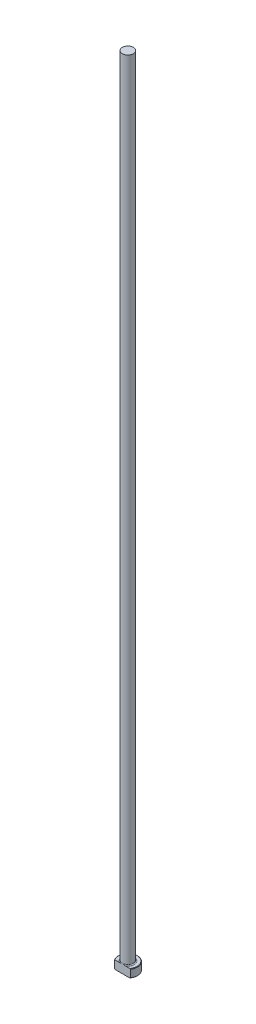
ISO-10303-21;
HEADER;
FILE_DESCRIPTION(('STEP AP214'),'2;1');
FILE_NAME('part.step','',(''),(''),'','','');
FILE_SCHEMA(('AUTOMOTIVE_DESIGN { 1 0 10303 214 1 1 1 1 }'));
ENDSEC;
DATA;
#1=APPLICATION_CONTEXT('core data for automotive mechanical design processes');
#2=APPLICATION_PROTOCOL_DEFINITION('international standard','automotive_design',2000,#1);
#3=PRODUCT_CONTEXT('',#1,'mechanical');
#4=PRODUCT('Part','Part','',(#3));
#5=PRODUCT_RELATED_PRODUCT_CATEGORY('part','',(#4));
#6=PRODUCT_DEFINITION_FORMATION('','',#4);
#7=PRODUCT_DEFINITION_CONTEXT('part definition',#1,'design');
#8=PRODUCT_DEFINITION('design','',#6,#7);
#9=PRODUCT_DEFINITION_SHAPE('','',#8);
#10=(LENGTH_UNIT() NAMED_UNIT(*) SI_UNIT(.MILLI.,.METRE.));
#11=(NAMED_UNIT(*) PLANE_ANGLE_UNIT() SI_UNIT($,.RADIAN.));
#12=(NAMED_UNIT(*) SI_UNIT($,.STERADIAN.) SOLID_ANGLE_UNIT());
#13=UNCERTAINTY_MEASURE_WITH_UNIT(LENGTH_MEASURE(1.E-05),#10,'distance_accuracy_value','');
#14=(GEOMETRIC_REPRESENTATION_CONTEXT(3) GLOBAL_UNCERTAINTY_ASSIGNED_CONTEXT((#13)) GLOBAL_UNIT_ASSIGNED_CONTEXT((#10,
#11,#12)) REPRESENTATION_CONTEXT('',''));
#15=CARTESIAN_POINT('',(0.,0.,0.));
#16=DIRECTION('',(0.,0.,1.));
#17=DIRECTION('',(1.,0.,0.));
#18=AXIS2_PLACEMENT_3D('',#15,#16,#17);
#19=CARTESIAN_POINT('',(0.,0.,0.));
#20=DIRECTION('',(0.,-1.,0.));
#21=DIRECTION('',(0.,0.,-1.));
#22=AXIS2_PLACEMENT_3D('',#19,#20,#21);
#23=PLANE('',#22);
#24=DIRECTION('',(1.,0.,0.));
#25=VECTOR('',#24,1.);
#26=CARTESIAN_POINT('',(-4.55200670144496,0.,3.17499999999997));
#27=LINE('',#26,#25);
#28=CARTESIAN_POINT('',(-4.23862381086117,0.,3.17499999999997));
#29=VERTEX_POINT('',#28);
#30=CARTESIAN_POINT('',(4.23862381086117,0.,3.17499999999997));
#31=VERTEX_POINT('',#30);
#32=EDGE_CURVE('E92',#29,#31,#27,.T.);
#33=ORIENTED_EDGE('',*,*,#32,.F.);
#34=CARTESIAN_POINT('',(0.,0.,0.));
#35=DIRECTION('',(0.,-1.,0.));
#36=DIRECTION('',(0.,0.,-1.));
#37=AXIS2_PLACEMENT_3D('',#34,#35,#36);
#38=CIRCLE('',#37,5.29589999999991);
#39=EDGE_CURVE('E105',#29,#31,#38,.T.);
#40=ORIENTED_EDGE('',*,*,#39,.T.);
#41=EDGE_LOOP('',(#33,#40));
#42=FACE_BOUND('',#41,.T.);
#43=ADVANCED_FACE('F37',(#42),#23,.T.);
#44=CARTESIAN_POINT('',(0.,259.958771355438,0.));
#45=DIRECTION('',(0.,1.,0.));
#46=DIRECTION('',(0.,0.,1.));
#47=AXIS2_PLACEMENT_3D('',#44,#45,#46);
#48=CYLINDRICAL_SURFACE('',#47,5.54989999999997);
#49=DIRECTION('',(0.,-1.,0.));
#50=VECTOR('',#49,1.);
#51=CARTESIAN_POINT('',(-4.55200670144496,457.2,3.17499999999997));
#52=LINE('',#51,#50);
#53=CARTESIAN_POINT('',(-4.55200670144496,4.49580000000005,3.17499999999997));
#54=VERTEX_POINT('',#53);
#55=CARTESIAN_POINT('',(-4.55200670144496,0.254000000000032,3.17499999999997));
#56=VERTEX_POINT('',#55);
#57=EDGE_CURVE('E95',#54,#56,#52,.T.);
#58=ORIENTED_EDGE('',*,*,#57,.F.);
#59=CARTESIAN_POINT('',(0.,4.49580000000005,0.));
#60=DIRECTION('',(0.,1.,0.));
#61=DIRECTION('',(0.,0.,1.));
#62=AXIS2_PLACEMENT_3D('',#59,#60,#61);
#63=CIRCLE('',#62,5.54989999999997);
#64=CARTESIAN_POINT('',(4.55200670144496,4.49580000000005,3.17499999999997));
#65=VERTEX_POINT('',#64);
#66=EDGE_CURVE('E109',#54,#65,#63,.F.);
#67=ORIENTED_EDGE('',*,*,#66,.T.);
#68=DIRECTION('',(0.,-1.,0.));
#69=VECTOR('',#68,1.);
#70=CARTESIAN_POINT('',(4.55200670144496,457.2,3.17499999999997));
#71=LINE('',#70,#69);
#72=CARTESIAN_POINT('',(4.55200670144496,0.254000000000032,3.17499999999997));
#73=VERTEX_POINT('',#72);
#74=EDGE_CURVE('E187',#65,#73,#71,.T.);
#75=ORIENTED_EDGE('',*,*,#74,.T.);
#76=CARTESIAN_POINT('',(0.,0.254000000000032,0.));
#77=DIRECTION('',(0.,-1.,0.));
#78=DIRECTION('',(0.,0.,-1.));
#79=AXIS2_PLACEMENT_3D('',#76,#77,#78);
#80=CIRCLE('',#79,5.54989999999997);
#81=EDGE_CURVE('E115',#73,#56,#80,.F.);
#82=ORIENTED_EDGE('',*,*,#81,.T.);
#83=EDGE_LOOP('',(#58,#67,#75,#82));
#84=FACE_BOUND('',#83,.T.);
#85=ADVANCED_FACE('F160',(#84),#48,.T.);
#86=CARTESIAN_POINT('',(-5.54989999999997,4.7498,0.));
#87=DIRECTION('',(0.,1.,0.));
#88=DIRECTION('',(0.,0.,1.));
#89=AXIS2_PLACEMENT_3D('',#86,#87,#88);
#90=PLANE('',#89);
#91=DIRECTION('',(-1.,0.,0.));
#92=VECTOR('',#91,1.);
#93=CARTESIAN_POINT('',(-5.54989999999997,4.7498,3.17499999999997));
#94=LINE('',#93,#92);
#95=CARTESIAN_POINT('',(4.23862381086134,4.7498,3.17499999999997));
#96=VERTEX_POINT('',#95);
#97=CARTESIAN_POINT('',(1.86651118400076,4.7498,3.17499999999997));
#98=VERTEX_POINT('',#97);
#99=EDGE_CURVE('E58',#96,#98,#94,.T.);
#100=ORIENTED_EDGE('',*,*,#99,.F.);
#101=CARTESIAN_POINT('',(0.,4.7498,0.));
#102=DIRECTION('',(0.,1.,0.));
#103=DIRECTION('',(0.,0.,1.));
#104=AXIS2_PLACEMENT_3D('',#101,#102,#103);
#105=CIRCLE('',#104,5.29590000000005);
#106=CARTESIAN_POINT('',(-4.23862381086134,4.7498,3.17499999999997));
#107=VERTEX_POINT('',#106);
#108=EDGE_CURVE('E182',#96,#107,#105,.T.);
#109=ORIENTED_EDGE('',*,*,#108,.T.);
#110=CARTESIAN_POINT('',(-1.86651118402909,4.74979999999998,3.17499999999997));
#111=VERTEX_POINT('',#110);
#112=EDGE_CURVE('E140',#111,#107,#94,.T.);
#113=ORIENTED_EDGE('',*,*,#112,.F.);
#114=CARTESIAN_POINT('',(0.,4.7498,0.));
#115=DIRECTION('',(0.,1.,0.));
#116=DIRECTION('',(0.,0.,1.));
#117=AXIS2_PLACEMENT_3D('',#114,#115,#116);
#118=CIRCLE('',#117,3.68299999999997);
#119=EDGE_CURVE('E112',#111,#98,#118,.F.);
#120=ORIENTED_EDGE('',*,*,#119,.T.);
#121=EDGE_LOOP('',(#100,#109,#113,#120));
#122=FACE_BOUND('',#121,.T.);
#123=ADVANCED_FACE('F164',(#122),#90,.T.);
#124=CARTESIAN_POINT('',(0.,259.958771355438,0.));
#125=DIRECTION('',(0.,1.,0.));
#126=DIRECTION('',(0.,0.,1.));
#127=AXIS2_PLACEMENT_3D('',#124,#125,#126);
#128=CYLINDRICAL_SURFACE('',#127,3.17499999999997);
#129=CARTESIAN_POINT('',(0.,5.25779999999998,0.));
#130=DIRECTION('',(0.,1.,0.));
#131=DIRECTION('',(0.,0.,1.));
#132=AXIS2_PLACEMENT_3D('',#129,#130,#131);
#133=CIRCLE('',#132,3.17499999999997);
#134=CARTESIAN_POINT('',(0.,5.25779999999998,3.17499999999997));
#135=VERTEX_POINT('',#134);
#136=EDGE_CURVE('E108',#135,#135,#133,.T.);
#137=ORIENTED_EDGE('',*,*,#136,.T.);
#138=EDGE_LOOP('',(#137));
#139=FACE_BOUND('',#138,.T.);
#140=CARTESIAN_POINT('',(0.,457.2,0.));
#141=DIRECTION('',(0.,1.,0.));
#142=DIRECTION('',(0.,0.,1.));
#143=AXIS2_PLACEMENT_3D('',#140,#141,#142);
#144=CIRCLE('',#143,3.17499999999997);
#145=CARTESIAN_POINT('',(0.,457.2,3.17499999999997));
#146=VERTEX_POINT('',#145);
#147=EDGE_CURVE('E100',#146,#146,#144,.T.);
#148=ORIENTED_EDGE('',*,*,#147,.F.);
#149=EDGE_LOOP('',(#148));
#150=FACE_BOUND('',#149,.T.);
#151=ADVANCED_FACE('F169',(#139,#150),#128,.T.);
#152=CARTESIAN_POINT('',(-3.17499999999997,457.2,0.));
#153=DIRECTION('',(0.,1.,0.));
#154=DIRECTION('',(0.,0.,1.));
#155=AXIS2_PLACEMENT_3D('',#152,#153,#154);
#156=PLANE('',#155);
#157=ORIENTED_EDGE('',*,*,#147,.T.);
#158=EDGE_LOOP('',(#157));
#159=FACE_BOUND('',#158,.T.);
#160=ADVANCED_FACE('F127',(#159),#156,.T.);
#161=CARTESIAN_POINT('',(0.,4.74980000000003,0.));
#162=DIRECTION('',(0.,-1.,0.));
#163=DIRECTION('',(0.,0.,-1.));
#164=AXIS2_PLACEMENT_3D('',#161,#162,#163);
#165=CONICAL_SURFACE('',#164,5.29590000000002,0.785398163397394);
#166=CARTESIAN_POINT('',(4.55270670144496,4.4952258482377,3.17499999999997));
#167=CARTESIAN_POINT('',(4.46867102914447,4.56415111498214,3.17499999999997));
#168=CARTESIAN_POINT('',(4.38433366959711,4.63270805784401,3.17499999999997));
#169=CARTESIAN_POINT('',(4.2149585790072,4.76896195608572,3.17499999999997));
#170=CARTESIAN_POINT('',(4.12992080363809,4.83665885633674,3.17499999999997));
#171=CARTESIAN_POINT('',(3.87336504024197,5.03846775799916,3.17499999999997));
#172=CARTESIAN_POINT('',(3.70066220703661,5.17108543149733,3.17499999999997));
#173=CARTESIAN_POINT('',(3.34705509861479,5.43386049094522,3.17499999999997));
#174=CARTESIAN_POINT('',(3.16605347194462,5.56388747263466,3.17499999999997));
#175=CARTESIAN_POINT('',(2.7984170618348,5.8156006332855,3.17499999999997));
#176=CARTESIAN_POINT('',(2.61178598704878,5.93729213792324,3.17499999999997));
#177=CARTESIAN_POINT('',(2.30973308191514,6.12043895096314,3.17499999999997));
#178=CARTESIAN_POINT('',(2.19679966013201,6.1859837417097,3.17499999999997));
#179=CARTESIAN_POINT('',(1.96784721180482,6.31155139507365,3.17499999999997));
#180=CARTESIAN_POINT('',(1.85182762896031,6.37157325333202,3.17499999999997));
#181=CARTESIAN_POINT('',(1.61688838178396,6.48418645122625,3.17499999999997));
#182=CARTESIAN_POINT('',(1.49798536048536,6.5368121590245,3.17499999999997));
#183=CARTESIAN_POINT('',(1.25651684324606,6.63289856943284,3.17499999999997));
#184=CARTESIAN_POINT('',(1.13395292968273,6.67636316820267,3.17499999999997));
#185=CARTESIAN_POINT('',(0.91783963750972,6.74185258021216,3.17499999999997));
#186=CARTESIAN_POINT('',(0.825091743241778,6.76651140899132,3.17499999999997));
#187=CARTESIAN_POINT('',(0.637965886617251,6.80852168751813,3.17499999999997));
#188=CARTESIAN_POINT('',(0.543588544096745,6.82587585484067,3.17499999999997));
#189=CARTESIAN_POINT('',(0.353913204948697,6.85241185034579,3.17499999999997));
#190=CARTESIAN_POINT('',(0.258618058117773,6.86161375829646,3.17499999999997));
#191=CARTESIAN_POINT('',(0.067581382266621,6.87141333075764,3.17499999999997));
#192=CARTESIAN_POINT('',(-0.0281601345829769,6.87201122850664,3.17499999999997));
#193=CARTESIAN_POINT('',(-0.219319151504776,6.86456808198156,3.17499999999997));
#194=CARTESIAN_POINT('',(-0.314736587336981,6.8565254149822,3.17499999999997));
#195=CARTESIAN_POINT('',(-0.504514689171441,6.83224444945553,3.17499999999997));
#196=CARTESIAN_POINT('',(-0.598875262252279,6.81600543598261,3.17499999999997));
#197=CARTESIAN_POINT('',(-0.786308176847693,6.77606898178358,3.17499999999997));
#198=CARTESIAN_POINT('',(-0.879375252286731,6.75234715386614,3.17499999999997));
#199=CARTESIAN_POINT('',(-1.06359579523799,6.69844771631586,3.17499999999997));
#200=CARTESIAN_POINT('',(-1.15474927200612,6.66827013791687,3.17499999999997));
#201=CARTESIAN_POINT('',(-1.35443704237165,6.59537857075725,3.17499999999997));
#202=CARTESIAN_POINT('',(-1.46249374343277,6.55136423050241,3.17499999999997));
#203=CARTESIAN_POINT('',(-1.67575460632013,6.45687950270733,3.17499999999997));
#204=CARTESIAN_POINT('',(-1.78095773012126,6.40640680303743,3.17499999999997));
#205=CARTESIAN_POINT('',(-1.98893047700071,6.30024153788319,3.17499999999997));
#206=CARTESIAN_POINT('',(-2.09169504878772,6.24453915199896,3.17499999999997));
#207=CARTESIAN_POINT('',(-2.29487199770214,6.12905867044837,3.17499999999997));
#208=CARTESIAN_POINT('',(-2.39528472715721,6.06928119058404,3.17499999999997));
#209=CARTESIAN_POINT('',(-2.59468704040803,5.94608525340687,3.17499999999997));
#210=CARTESIAN_POINT('',(-2.69366424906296,5.88264685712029,3.17499999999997));
#211=CARTESIAN_POINT('',(-2.88985302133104,5.75309438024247,3.17499999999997));
#212=CARTESIAN_POINT('',(-2.98706447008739,5.68698012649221,3.17499999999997));
#213=CARTESIAN_POINT('',(-3.27623595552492,5.48553168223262,3.17499999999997));
#214=CARTESIAN_POINT('',(-3.46594038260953,5.34696081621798,3.17499999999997));
#215=CARTESIAN_POINT('',(-3.80657840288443,5.08982954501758,3.17499999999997));
#216=CARTESIAN_POINT('',(-3.95825741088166,4.97224445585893,3.17499999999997));
#217=CARTESIAN_POINT('',(-4.1832860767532,4.79418265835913,3.17499999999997));
#218=CARTESIAN_POINT('',(-4.25753159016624,4.73483567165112,3.17499999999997));
#219=CARTESIAN_POINT('',(-4.40549753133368,4.61549484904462,3.17499999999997));
#220=CARTESIAN_POINT('',(-4.47921797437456,4.55550103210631,3.17499999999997));
#221=CARTESIAN_POINT('',(-4.55270670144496,4.4952258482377,3.17499999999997));
#222=B_SPLINE_CURVE_WITH_KNOTS('',3,(#166,#167,#168,#169,#170,#171,#172,#173,#174,#175,#176,
#177,#178,#179,#180,#181,#182,#183,#184,#185,#186,#187,#188,#189,#190,#191,#192,#193,#194,#195,
#196,#197,#198,#199,#200,#201,#202,#203,#204,#205,#206,#207,#208,#209,#210,#211,#212,#213,#214,
#215,#216,#217,#218,#219,#220,#221),.UNSPECIFIED.,.F.,.F.,(4,2,2,2,2,2,2,2,2,2,2,2,2,2,2,2,2,2,
2,2,2,2,2,2,2,2,2,4),(0.,0.32605601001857,0.652132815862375,1.30528807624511,1.97374354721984,
2.64176786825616,3.03338079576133,3.42506479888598,3.81486388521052,4.20449685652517,
4.49215659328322,4.77970921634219,5.06655158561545,5.35338617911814,5.64027465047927,
5.92718815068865,6.2150465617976,6.50290358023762,6.85266171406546,7.20254541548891,
7.5530998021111,7.90360133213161,8.25623530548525,8.60889213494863,9.31347102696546,
9.88918933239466,10.174335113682,10.459472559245),.UNSPECIFIED.);
#223=EDGE_CURVE('E63',#65,#96,#222,.T.);
#224=ORIENTED_EDGE('',*,*,#223,.F.);
#225=ORIENTED_EDGE('',*,*,#66,.F.);
#226=EDGE_CURVE('E133',#107,#54,#222,.T.);
#227=ORIENTED_EDGE('',*,*,#226,.F.);
#228=ORIENTED_EDGE('',*,*,#108,.F.);
#229=EDGE_LOOP('',(#224,#225,#227,#228));
#230=FACE_BOUND('',#229,.T.);
#231=ADVANCED_FACE('F147',(#230),#165,.T.);
#232=CARTESIAN_POINT('',(0.,0.254000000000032,0.));
#233=DIRECTION('',(0.,1.,0.));
#234=DIRECTION('',(0.,0.,1.));
#235=AXIS2_PLACEMENT_3D('',#232,#233,#234);
#236=CONICAL_SURFACE('',#235,5.54989999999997,0.785398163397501);
#237=CARTESIAN_POINT('',(-4.55270670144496,0.254574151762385,3.17499999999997));
#238=CARTESIAN_POINT('',(-4.46867102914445,0.185648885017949,3.17499999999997));
#239=CARTESIAN_POINT('',(-4.38433366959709,0.117091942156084,3.17499999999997));
#240=CARTESIAN_POINT('',(-4.21495857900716,-0.0191619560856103,3.17499999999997));
#241=CARTESIAN_POINT('',(-4.12992080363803,-0.0868588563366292,3.17499999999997));
#242=CARTESIAN_POINT('',(-3.87336504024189,-0.288667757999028,3.17499999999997));
#243=CARTESIAN_POINT('',(-3.70066220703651,-0.42128543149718,3.17499999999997));
#244=CARTESIAN_POINT('',(-3.34705509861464,-0.684060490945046,3.17499999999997));
#245=CARTESIAN_POINT('',(-3.16605347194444,-0.814087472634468,3.17499999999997));
#246=CARTESIAN_POINT('',(-2.79841706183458,-1.06580063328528,3.17499999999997));
#247=CARTESIAN_POINT('',(-2.61178598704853,-1.187492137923,3.17499999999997));
#248=CARTESIAN_POINT('',(-2.30973308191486,-1.37063895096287,3.17499999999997));
#249=CARTESIAN_POINT('',(-2.19679966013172,-1.43618374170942,3.17499999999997));
#250=CARTESIAN_POINT('',(-1.96784721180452,-1.56175139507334,3.17499999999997));
#251=CARTESIAN_POINT('',(-1.85182762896,-1.62177325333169,3.17499999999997));
#252=CARTESIAN_POINT('',(-1.61688838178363,-1.73438645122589,3.17499999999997));
#253=CARTESIAN_POINT('',(-1.49798536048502,-1.78701215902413,3.17499999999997));
#254=CARTESIAN_POINT('',(-1.2565168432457,-1.88309856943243,3.17499999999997));
#255=CARTESIAN_POINT('',(-1.13395292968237,-1.92656316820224,3.17499999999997));
#256=CARTESIAN_POINT('',(-0.917839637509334,-1.9920525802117,3.17499999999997));
#257=CARTESIAN_POINT('',(-0.825091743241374,-2.01671140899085,3.17499999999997));
#258=CARTESIAN_POINT('',(-0.637965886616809,-2.05872168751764,3.17499999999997));
#259=CARTESIAN_POINT('',(-0.543588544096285,-2.07607585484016,3.17499999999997));
#260=CARTESIAN_POINT('',(-0.353913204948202,-2.10261185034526,3.17499999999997));
#261=CARTESIAN_POINT('',(-0.25861805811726,-2.11181375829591,3.17499999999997));
#262=CARTESIAN_POINT('',(-0.0675813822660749,-2.12161333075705,3.17499999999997));
#263=CARTESIAN_POINT('',(0.0281601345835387,-2.12221122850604,3.17499999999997));
#264=CARTESIAN_POINT('',(0.219319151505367,-2.11476808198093,3.17499999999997));
#265=CARTESIAN_POINT('',(0.314736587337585,-2.10672541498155,3.17499999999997));
#266=CARTESIAN_POINT('',(0.504514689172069,-2.08244444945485,3.17499999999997));
#267=CARTESIAN_POINT('',(0.598875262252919,-2.06620543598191,3.17499999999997));
#268=CARTESIAN_POINT('',(0.786308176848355,-2.02626898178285,3.17499999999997));
#269=CARTESIAN_POINT('',(0.879375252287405,-2.00254715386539,3.17499999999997));
#270=CARTESIAN_POINT('',(1.06359579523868,-1.94864771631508,3.17499999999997));
#271=CARTESIAN_POINT('',(1.15474927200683,-1.91847013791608,3.17499999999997));
#272=CARTESIAN_POINT('',(1.35443704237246,-1.8455785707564,3.17499999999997));
#273=CARTESIAN_POINT('',(1.46249374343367,-1.80156423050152,3.17499999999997));
#274=CARTESIAN_POINT('',(1.6757546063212,-1.70707950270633,3.17499999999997));
#275=CARTESIAN_POINT('',(1.78095773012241,-1.65660680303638,3.17499999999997));
#276=CARTESIAN_POINT('',(1.98893047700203,-1.55044153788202,3.17499999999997));
#277=CARTESIAN_POINT('',(2.09169504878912,-1.49473915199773,3.17499999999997));
#278=CARTESIAN_POINT('',(2.2948719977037,-1.37925867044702,3.17499999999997));
#279=CARTESIAN_POINT('',(2.39528472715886,-1.31948119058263,3.17499999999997));
#280=CARTESIAN_POINT('',(2.59468704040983,-1.19628525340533,3.17499999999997));
#281=CARTESIAN_POINT('',(2.69366424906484,-1.13284685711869,3.17499999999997));
#282=CARTESIAN_POINT('',(2.88985302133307,-1.00329438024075,3.17499999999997));
#283=CARTESIAN_POINT('',(2.98706447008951,-0.937180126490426,3.17499999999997));
#284=CARTESIAN_POINT('',(3.27623595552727,-0.735731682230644,3.17499999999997));
#285=CARTESIAN_POINT('',(3.46594038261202,-0.597160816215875,3.17499999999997));
#286=CARTESIAN_POINT('',(3.80657840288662,-0.340029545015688,3.17499999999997));
#287=CARTESIAN_POINT('',(3.9582574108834,-0.222444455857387,3.17499999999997));
#288=CARTESIAN_POINT('',(4.18328607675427,-0.0443826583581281,3.17499999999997));
#289=CARTESIAN_POINT('',(4.25753159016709,0.0149643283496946,3.17499999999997));
#290=CARTESIAN_POINT('',(4.4054975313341,0.134305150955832,3.17499999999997));
#291=CARTESIAN_POINT('',(4.47921797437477,0.194298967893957,3.17499999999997));
#292=CARTESIAN_POINT('',(4.55270670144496,0.254574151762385,3.17499999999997));
#293=B_SPLINE_CURVE_WITH_KNOTS('',3,(#237,#238,#239,#240,#241,#242,#243,#244,#245,#246,#247,
#248,#249,#250,#251,#252,#253,#254,#255,#256,#257,#258,#259,#260,#261,#262,#263,#264,#265,#266,
#267,#268,#269,#270,#271,#272,#273,#274,#275,#276,#277,#278,#279,#280,#281,#282,#283,#284,#285,
#286,#287,#288,#289,#290,#291,#292),.UNSPECIFIED.,.F.,.F.,(4,2,2,2,2,2,2,2,2,2,2,2,2,2,2,2,2,2,
2,2,2,2,2,2,2,2,2,4),(0.,0.326056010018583,0.6521328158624,1.30528807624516,1.97374354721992,
2.64176786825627,3.03338079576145,3.4250647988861,3.81486388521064,4.20449685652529,
4.49215659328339,4.77970921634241,5.06655158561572,5.35338617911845,5.64027465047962,
5.92718815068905,6.21504656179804,6.50290358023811,6.85266171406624,7.20254541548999,
7.55309980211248,7.9036013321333,8.25623530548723,8.60889213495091,9.31347102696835,
9.88918933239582,10.1743351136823,10.4594725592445),.UNSPECIFIED.);
#294=EDGE_CURVE('E89',#56,#29,#293,.T.);
#295=ORIENTED_EDGE('',*,*,#294,.F.);
#296=ORIENTED_EDGE('',*,*,#81,.F.);
#297=EDGE_CURVE('E101',#31,#73,#293,.T.);
#298=ORIENTED_EDGE('',*,*,#297,.F.);
#299=ORIENTED_EDGE('',*,*,#39,.F.);
#300=EDGE_LOOP('',(#295,#296,#298,#299));
#301=FACE_BOUND('',#300,.T.);
#302=ADVANCED_FACE('F107',(#301),#236,.T.);
#303=CARTESIAN_POINT('',(0.,5.25779999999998,0.));
#304=DIRECTION('',(0.,1.,0.));
#305=DIRECTION('',(0.,0.,1.));
#306=AXIS2_PLACEMENT_3D('',#303,#304,#305);
#307=TOROIDAL_SURFACE('',#306,3.68299999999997,0.508);
#308=ORIENTED_EDGE('',*,*,#119,.F.);
#309=CARTESIAN_POINT('',(0.,5.25779999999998,3.17499999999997));
#310=CARTESIAN_POINT('',(-1.80769053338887E-10,5.25780081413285,3.17499999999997));
#311=CARTESIAN_POINT('',(-1.73023885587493E-07,5.25780162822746,3.17499999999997));
#312=CARTESIAN_POINT('',(-7.19628533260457E-07,5.25780319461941,3.17499999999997));
#313=CARTESIAN_POINT('',(-1.09883574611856E-06,5.25780394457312,3.17499999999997));
#314=CARTESIAN_POINT('',(-2.00966877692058E-06,5.25780544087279,3.17499999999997));
#315=CARTESIAN_POINT('',(-2.55212990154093E-06,5.25780618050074,3.17499999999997));
#316=CARTESIAN_POINT('',(-3.72136332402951E-06,5.25780757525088,3.17499999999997));
#317=CARTESIAN_POINT('',(-4.34736599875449E-06,5.25780823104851,3.17499999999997));
#318=CARTESIAN_POINT('',(-6.59438229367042E-06,5.25781043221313,3.17499999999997));
#319=CARTESIAN_POINT('',(-8.32481538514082E-06,5.25781186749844,3.17499999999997));
#320=CARTESIAN_POINT('',(-1.18988287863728E-05,5.25781442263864,3.17499999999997));
#321=CARTESIAN_POINT('',(-1.37358815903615E-05,5.25781555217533,3.17499999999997));
#322=CARTESIAN_POINT('',(-2.09135300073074E-05,5.25781980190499,3.17499999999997));
#323=CARTESIAN_POINT('',(-2.63912469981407E-05,5.25782270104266,3.17499999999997));
#324=CARTESIAN_POINT('',(-3.71867761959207E-05,5.25782743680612,3.17499999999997));
#325=CARTESIAN_POINT('',(-4.24736618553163E-05,5.25782934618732,3.17499999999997));
#326=CARTESIAN_POINT('',(-6.50188365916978E-05,5.25783746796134,3.17499999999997));
#327=CARTESIAN_POINT('',(-8.22815781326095E-05,5.25784363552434,3.17499999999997));
#328=CARTESIAN_POINT('',(-0.000114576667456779,5.25785352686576,3.17499999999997));
#329=CARTESIAN_POINT('',(-0.000129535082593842,5.25785748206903,3.17499999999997));
#330=CARTESIAN_POINT('',(-0.000238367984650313,5.25788883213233,3.17499999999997));
#331=CARTESIAN_POINT('',(-0.000328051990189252,5.25792882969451,3.17499999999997));
#332=CARTESIAN_POINT('',(-0.000676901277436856,5.25807871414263,3.17499999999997));
#333=CARTESIAN_POINT('',(-0.000938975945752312,5.25817923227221,3.17499999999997));
#334=CARTESIAN_POINT('',(-0.001957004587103,5.25857549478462,3.17499999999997));
#335=CARTESIAN_POINT('',(-0.00270997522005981,5.25888105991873,3.17499999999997));
#336=CARTESIAN_POINT('',(-0.00579427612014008,5.26012678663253,3.17499999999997));
#337=CARTESIAN_POINT('',(-0.00812889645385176,5.26105588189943,3.17499999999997));
#338=CARTESIAN_POINT('',(-0.0536737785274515,5.27918868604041,3.17499999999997));
#339=CARTESIAN_POINT('',(-0.0968493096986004,5.29651116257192,3.17499999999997));
#340=CARTESIAN_POINT('',(-0.181675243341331,5.33030366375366,3.17499999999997));
#341=CARTESIAN_POINT('',(-0.22332279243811,5.34678146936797,3.17499999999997));
#342=CARTESIAN_POINT('',(-0.311600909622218,5.38141206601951,3.17499999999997));
#343=CARTESIAN_POINT('',(-0.358243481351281,5.39953485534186,3.17499999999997));
#344=CARTESIAN_POINT('',(-0.452199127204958,5.43546002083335,3.17499999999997));
#345=CARTESIAN_POINT('',(-0.499514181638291,5.4532572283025,3.17499999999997));
#346=CARTESIAN_POINT('',(-0.581915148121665,5.48356219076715,3.17499999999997));
#347=CARTESIAN_POINT('',(-0.616942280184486,5.49622931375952,3.17499999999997));
#348=CARTESIAN_POINT('',(-0.687074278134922,5.52107238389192,3.17499999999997));
#349=CARTESIAN_POINT('',(-0.722178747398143,5.53324945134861,3.17499999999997));
#350=CARTESIAN_POINT('',(-0.82617821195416,5.56842938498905,3.17499999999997));
#351=CARTESIAN_POINT('',(-0.895335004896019,5.59066808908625,3.17499999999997));
#352=CARTESIAN_POINT('',(-1.04440355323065,5.63534989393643,3.17499999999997));
#353=CARTESIAN_POINT('',(-1.12444395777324,5.65737079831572,3.17499999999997));
#354=CARTESIAN_POINT('',(-1.28636529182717,5.69671209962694,3.17499999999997));
#355=CARTESIAN_POINT('',(-1.36825573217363,5.71399428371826,3.17499999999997));
#356=CARTESIAN_POINT('',(-1.53827501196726,5.74289044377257,3.17499999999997));
#357=CARTESIAN_POINT('',(-1.6264772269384,5.754089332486,3.17499999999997));
#358=CARTESIAN_POINT('',(-1.80336979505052,5.766538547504,3.17499999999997));
#359=CARTESIAN_POINT('',(-1.89205668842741,5.76782927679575,3.17499999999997));
#360=CARTESIAN_POINT('',(-2.04614946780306,5.75829207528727,3.17499999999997));
#361=CARTESIAN_POINT('',(-2.1117267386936,5.7504696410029,3.17499999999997));
#362=CARTESIAN_POINT('',(-2.24032569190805,5.72527330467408,3.17499999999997));
#363=CARTESIAN_POINT('',(-2.30336992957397,5.70802985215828,3.17499999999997));
#364=CARTESIAN_POINT('',(-2.3964725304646,5.67213651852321,3.17499999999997));
#365=CARTESIAN_POINT('',(-2.42822079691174,5.65788049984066,3.17499999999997));
#366=CARTESIAN_POINT('',(-2.48965433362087,5.62525897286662,3.17499999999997));
#367=CARTESIAN_POINT('',(-2.51933677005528,5.60688795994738,3.17499999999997));
#368=CARTESIAN_POINT('',(-2.56994777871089,5.56951032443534,3.17499999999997));
#369=CARTESIAN_POINT('',(-2.59146237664,5.55130442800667,3.17499999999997));
#370=CARTESIAN_POINT('',(-2.63132394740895,5.5117021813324,3.17499999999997));
#371=CARTESIAN_POINT('',(-2.64967743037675,5.49031256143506,3.17499999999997));
#372=CARTESIAN_POINT('',(-2.67804602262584,5.4500327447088,3.17499999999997));
#373=CARTESIAN_POINT('',(-2.6890027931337,5.43180880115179,3.17499999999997));
#374=CARTESIAN_POINT('',(-2.7078017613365,5.3938065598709,3.17499999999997));
#375=CARTESIAN_POINT('',(-2.71564587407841,5.37402922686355,3.17499999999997));
#376=CARTESIAN_POINT('',(-2.72769754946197,5.33322214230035,3.17499999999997));
#377=CARTESIAN_POINT('',(-2.73187843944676,5.31218437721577,3.17499999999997));
#378=CARTESIAN_POINT('',(-2.73613267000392,5.26969745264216,3.17499999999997));
#379=CARTESIAN_POINT('',(-2.73620805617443,5.24824850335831,3.17499999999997));
#380=CARTESIAN_POINT('',(-2.73247730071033,5.20813635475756,3.17499999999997));
#381=CARTESIAN_POINT('',(-2.72910595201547,5.18943073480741,3.17499999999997));
#382=CARTESIAN_POINT('',(-2.71937153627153,5.15282145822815,3.17499999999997));
#383=CARTESIAN_POINT('',(-2.71300800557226,5.13491792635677,3.17499999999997));
#384=CARTESIAN_POINT('',(-2.69740230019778,5.0996670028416,3.17499999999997));
#385=CARTESIAN_POINT('',(-2.68806645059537,5.08236154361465,3.17499999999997));
#386=CARTESIAN_POINT('',(-2.66708571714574,5.04922644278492,3.17499999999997));
#387=CARTESIAN_POINT('',(-2.65543987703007,5.03339741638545,3.17499999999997));
#388=CARTESIAN_POINT('',(-2.62294588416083,4.99450310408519,3.17499999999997));
#389=CARTESIAN_POINT('',(-2.60069446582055,4.9726078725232,3.17499999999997));
#390=CARTESIAN_POINT('',(-2.55299669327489,4.93259922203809,3.17499999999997));
#391=CARTESIAN_POINT('',(-2.52754047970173,4.91449795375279,3.17499999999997));
#392=CARTESIAN_POINT('',(-2.46015073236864,4.87290115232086,3.17499999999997));
#393=CARTESIAN_POINT('',(-2.41675555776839,4.85178783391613,3.17499999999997));
#394=CARTESIAN_POINT('',(-2.32743780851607,4.81642640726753,3.17499999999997));
#395=CARTESIAN_POINT('',(-2.28151740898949,4.80217249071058,3.17499999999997));
#396=CARTESIAN_POINT('',(-2.19492730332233,4.78086425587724,3.17499999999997));
#397=CARTESIAN_POINT('',(-2.15443153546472,4.77307762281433,3.17499999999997));
#398=CARTESIAN_POINT('',(-2.07290577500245,4.7609987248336,3.17499999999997));
#399=CARTESIAN_POINT('',(-2.03187536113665,4.75670940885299,3.17499999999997));
#400=CARTESIAN_POINT('',(-1.90717655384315,4.74822293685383,3.17499999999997));
#401=CARTESIAN_POINT('',(-1.82319261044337,4.74868666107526,3.17499999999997));
#402=CARTESIAN_POINT('',(-1.62833175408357,4.76032593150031,3.17499999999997));
#403=CARTESIAN_POINT('',(-1.51770881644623,4.77497959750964,3.17499999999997));
#404=CARTESIAN_POINT('',(-1.29813873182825,4.81534590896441,3.17499999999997));
#405=CARTESIAN_POINT('',(-1.18920134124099,4.84110792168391,3.17499999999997));
#406=CARTESIAN_POINT('',(-0.982215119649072,4.89780610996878,3.17499999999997));
#407=CARTESIAN_POINT('',(-0.883999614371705,4.92815337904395,3.17499999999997));
#408=CARTESIAN_POINT('',(-0.689996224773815,4.99284004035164,3.17499999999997));
#409=CARTESIAN_POINT('',(-0.594193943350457,5.02713703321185,3.17499999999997));
#410=CARTESIAN_POINT('',(-0.464142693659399,5.07567249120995,3.17499999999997));
#411=CARTESIAN_POINT('',(-0.429471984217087,5.08880513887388,3.17499999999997));
#412=CARTESIAN_POINT('',(-0.359331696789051,5.11568278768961,3.17499999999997));
#413=CARTESIAN_POINT('',(-0.323864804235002,5.12943483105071,3.17499999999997));
#414=CARTESIAN_POINT('',(-0.263992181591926,5.15284621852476,3.17499999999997));
#415=CARTESIAN_POINT('',(-0.239565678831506,5.16245280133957,3.17499999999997));
#416=CARTESIAN_POINT('',(-0.190982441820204,5.18164529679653,3.17499999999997));
#417=CARTESIAN_POINT('',(-0.166825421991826,5.19123047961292,3.17499999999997));
#418=CARTESIAN_POINT('',(-0.121037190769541,5.20943918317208,3.17499999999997));
#419=CARTESIAN_POINT('',(-0.0994044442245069,5.21805909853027,3.17499999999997));
#420=CARTESIAN_POINT('',(-0.0553410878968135,5.2356763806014,3.17499999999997));
#421=CARTESIAN_POINT('',(-0.0329111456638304,5.24467572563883,3.17499999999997));
#422=CARTESIAN_POINT('',(-0.00813211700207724,5.25454302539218,3.17499999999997));
#423=CARTESIAN_POINT('',(-0.00580062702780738,5.25547072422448,3.17499999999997));
#424=CARTESIAN_POINT('',(-0.00271708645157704,5.25671609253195,3.17499999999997));
#425=CARTESIAN_POINT('',(-0.00196172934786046,5.25702263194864,3.17499999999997));
#426=CARTESIAN_POINT('',(-0.000940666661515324,5.25742007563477,3.17499999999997));
#427=CARTESIAN_POINT('',(-0.000677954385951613,5.25752083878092,3.17499999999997));
#428=CARTESIAN_POINT('',(-0.000328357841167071,5.25767104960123,3.17499999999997));
#429=CARTESIAN_POINT('',(-0.000238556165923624,5.25771109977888,3.17499999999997));
#430=CARTESIAN_POINT('',(-0.000129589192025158,5.25774247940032,3.17499999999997));
#431=CARTESIAN_POINT('',(-0.000114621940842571,5.25774643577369,3.17499999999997));
#432=CARTESIAN_POINT('',(-8.23074123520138E-05,5.25775633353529,3.17499999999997));
#433=CARTESIAN_POINT('',(-6.50343069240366E-05,5.25776250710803,3.17499999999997));
#434=CARTESIAN_POINT('',(-4.24775013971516E-05,5.25777063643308,3.17499999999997));
#435=CARTESIAN_POINT('',(-3.71892385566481E-05,5.25777254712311,3.17499999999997));
#436=CARTESIAN_POINT('',(-2.63911145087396E-05,5.25777728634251,3.17499999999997));
#437=CARTESIAN_POINT('',(-2.09122302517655E-05,5.25778018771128,3.17499999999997));
#438=CARTESIAN_POINT('',(-1.37334835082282E-05,5.25778444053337,3.17499999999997));
#439=CARTESIAN_POINT('',(-1.189632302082E-05,5.25778557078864,3.17499999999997));
#440=CARTESIAN_POINT('',(-8.32223670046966E-06,5.25778812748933,3.17499999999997));
#441=CARTESIAN_POINT('',(-6.59184566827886E-06,5.25778956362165,3.17499999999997));
#442=CARTESIAN_POINT('',(-4.34505756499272E-06,5.25779176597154,3.17499999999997));
#443=CARTESIAN_POINT('',(-3.71915459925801E-06,5.25779242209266,3.17499999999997));
#444=CARTESIAN_POINT('',(-2.55017854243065E-06,5.25779381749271,3.17499999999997));
#445=CARTESIAN_POINT('',(-2.00787573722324E-06,5.25779455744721,3.17499999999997));
#446=CARTESIAN_POINT('',(-1.09742559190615E-06,5.25779605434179,3.17499999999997));
#447=CARTESIAN_POINT('',(-7.18435041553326E-07,5.25779680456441,3.17499999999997));
#448=CARTESIAN_POINT('',(-1.72356606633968E-07,5.25779837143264,3.17499999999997));
#449=CARTESIAN_POINT('',(1.80798290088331E-10,5.25779918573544,3.17499999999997));
#450=CARTESIAN_POINT('',(0.,5.25779999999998,3.17499999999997));
#451=B_SPLINE_CURVE_WITH_KNOTS('',3,(#309,#310,#311,#312,#313,#314,#315,#316,#317,#318,#319,
#320,#321,#322,#323,#324,#325,#326,#327,#328,#329,#330,#331,#332,#333,#334,#335,#336,#337,#338,
#339,#340,#341,#342,#343,#344,#345,#346,#347,#348,#349,#350,#351,#352,#353,#354,#355,#356,#357,
#358,#359,#360,#361,#362,#363,#364,#365,#366,#367,#368,#369,#370,#371,#372,#373,#374,#375,#376,
#377,#378,#379,#380,#381,#382,#383,#384,#385,#386,#387,#388,#389,#390,#391,#392,#393,#394,#395,
#396,#397,#398,#399,#400,#401,#402,#403,#404,#405,#406,#407,#408,#409,#410,#411,#412,#413,#414,
#415,#416,#417,#418,#419,#420,#421,#422,#423,#424,#425,#426,#427,#428,#429,#430,#431,#432,#433,
#434,#435,#436,#437,#438,#439,#440,#441,#442,#443,#444,#445,#446,#447,#448,#449,#450),
.UNSPECIFIED.,.T.,.F.,(4,2,2,2,2,2,2,2,2,2,2,2,2,2,2,2,2,2,2,2,2,2,2,2,2,2,2,2,2,2,2,2,2,2,2,2,
2,2,2,2,2,2,2,2,2,2,2,2,2,2,2,2,2,2,2,2,2,2,2,2,2,2,2,2,2,2,2,2,2,2,4),(0.,2.44115442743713E-06,
4.95009294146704E-06,7.69053481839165E-06,1.04072793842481E-05,1.71193004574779E-05,
2.35837539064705E-05,4.21184942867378E-05,5.89639869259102E-05,0.000113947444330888,
0.00016032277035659,0.000453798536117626,0.00129678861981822,0.00373346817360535,
0.0112727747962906,0.150820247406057,0.285189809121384,0.435305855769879,0.586956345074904,
0.698695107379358,0.810161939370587,1.02805278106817,1.27698376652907,1.52786673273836,
1.79421526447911,2.05947711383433,2.25711645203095,2.4520860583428,2.55626736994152,
2.66058888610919,2.74486087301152,2.82895717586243,2.89250582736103,2.95601532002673,
3.01998348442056,3.08391977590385,3.14067853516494,3.1974460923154,3.25621727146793,
3.31501283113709,3.4081316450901,3.50154427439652,3.64551034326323,3.78935429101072,
3.91289118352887,4.03653213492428,4.28773663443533,4.6216869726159,4.95713698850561,
5.26538775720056,5.57059335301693,5.68181719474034,5.79593491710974,5.87467803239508,
5.9526448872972,6.02250735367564,6.09500368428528,6.10253275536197,6.10497716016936,
6.10582220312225,6.10611606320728,6.1061624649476,6.10621748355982,6.10623433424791,
6.10625287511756,6.10625934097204,6.10626605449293,6.10626877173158,6.10627151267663,
6.10627402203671,6.10627646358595),.UNSPECIFIED.);
#452=EDGE_CURVE('E11',#111,#135,#451,.T.);
#453=ORIENTED_EDGE('',*,*,#452,.T.);
#454=ORIENTED_EDGE('',*,*,#136,.F.);
#455=CARTESIAN_POINT('',(0.,5.25779999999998,3.17499999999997));
#456=CARTESIAN_POINT('',(1.8076887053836E-10,5.25779918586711,3.17499999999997));
#457=CARTESIAN_POINT('',(1.73023885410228E-07,5.25779837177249,3.17499999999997));
#458=CARTESIAN_POINT('',(7.19628533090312E-07,5.25779680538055,3.17499999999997));
#459=CARTESIAN_POINT('',(1.09883574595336E-06,5.25779605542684,3.17499999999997));
#460=CARTESIAN_POINT('',(2.00966877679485E-06,5.25779455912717,3.17499999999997));
#461=CARTESIAN_POINT('',(2.55212990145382E-06,5.25779381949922,3.17499999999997));
#462=CARTESIAN_POINT('',(3.72136332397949E-06,5.25779242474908,3.17499999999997));
#463=CARTESIAN_POINT('',(4.34736599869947E-06,5.25779176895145,3.17499999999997));
#464=CARTESIAN_POINT('',(6.59438229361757E-06,5.25778956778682,3.17499999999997));
#465=CARTESIAN_POINT('',(8.32481538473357E-06,5.25778813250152,3.17499999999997));
#466=CARTESIAN_POINT('',(1.18988287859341E-05,5.25778557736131,3.17499999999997));
#467=CARTESIAN_POINT('',(1.37358815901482E-05,5.25778444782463,3.17499999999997));
#468=CARTESIAN_POINT('',(2.09135300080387E-05,5.25778019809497,3.17499999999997));
#469=CARTESIAN_POINT('',(2.63912469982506E-05,5.2577772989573,3.17499999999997));
#470=CARTESIAN_POINT('',(3.71867761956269E-05,5.25777256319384,3.17499999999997));
#471=CARTESIAN_POINT('',(4.24736618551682E-05,5.25777065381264,3.17499999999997));
#472=CARTESIAN_POINT('',(6.50188365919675E-05,5.25776253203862,3.17499999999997));
#473=CARTESIAN_POINT('',(8.22815781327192E-05,5.25775636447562,3.17499999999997));
#474=CARTESIAN_POINT('',(0.000114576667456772,5.2577464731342,3.17499999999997));
#475=CARTESIAN_POINT('',(0.00012953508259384,5.25774251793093,3.17499999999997));
#476=CARTESIAN_POINT('',(0.000238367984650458,5.25771116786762,3.17499999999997));
#477=CARTESIAN_POINT('',(0.000328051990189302,5.25767117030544,3.17499999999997));
#478=CARTESIAN_POINT('',(0.00067690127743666,5.25752128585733,3.17499999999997));
#479=CARTESIAN_POINT('',(0.000938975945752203,5.25742076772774,3.17499999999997));
#480=CARTESIAN_POINT('',(0.00195700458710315,5.25702450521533,3.17499999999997));
#481=CARTESIAN_POINT('',(0.00270997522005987,5.25671894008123,3.17499999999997));
#482=CARTESIAN_POINT('',(0.00579427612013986,5.25547321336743,3.17499999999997));
#483=CARTESIAN_POINT('',(0.00812889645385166,5.25454411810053,3.17499999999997));
#484=CARTESIAN_POINT('',(0.0536737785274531,5.23641131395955,3.17499999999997));
#485=CARTESIAN_POINT('',(0.0968493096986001,5.21908883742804,3.17499999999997));
#486=CARTESIAN_POINT('',(0.181675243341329,5.1852963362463,3.17499999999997));
#487=CARTESIAN_POINT('',(0.223322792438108,5.16881853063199,3.17499999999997));
#488=CARTESIAN_POINT('',(0.311600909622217,5.13418793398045,3.17499999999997));
#489=CARTESIAN_POINT('',(0.35824348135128,5.1160651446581,3.17499999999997));
#490=CARTESIAN_POINT('',(0.452199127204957,5.08013997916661,3.17499999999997));
#491=CARTESIAN_POINT('',(0.49951418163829,5.06234277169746,3.17499999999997));
#492=CARTESIAN_POINT('',(0.581915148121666,5.03203780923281,3.17499999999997));
#493=CARTESIAN_POINT('',(0.616942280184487,5.01937068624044,3.17499999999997));
#494=CARTESIAN_POINT('',(0.687074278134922,4.99452761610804,3.17499999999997));
#495=CARTESIAN_POINT('',(0.722178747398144,4.98235054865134,3.17499999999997));
#496=CARTESIAN_POINT('',(0.826178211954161,4.94717061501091,3.17499999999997));
#497=CARTESIAN_POINT('',(0.895335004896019,4.9249319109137,3.17499999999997));
#498=CARTESIAN_POINT('',(1.04440355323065,4.88025010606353,3.17499999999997));
#499=CARTESIAN_POINT('',(1.12444395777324,4.85822920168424,3.17499999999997));
#500=CARTESIAN_POINT('',(1.28636529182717,4.81888790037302,3.17499999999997));
#501=CARTESIAN_POINT('',(1.36825573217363,4.8016057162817,3.17499999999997));
#502=CARTESIAN_POINT('',(1.53827501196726,4.77270955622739,3.17499999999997));
#503=CARTESIAN_POINT('',(1.6264772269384,4.76151066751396,3.17499999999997));
#504=CARTESIAN_POINT('',(1.80336979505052,4.74906145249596,3.17499999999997));
#505=CARTESIAN_POINT('',(1.89205668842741,4.74777072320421,3.17499999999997));
#506=CARTESIAN_POINT('',(2.04614946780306,4.75730792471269,3.17499999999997));
#507=CARTESIAN_POINT('',(2.1117267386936,4.76513035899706,3.17499999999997));
#508=CARTESIAN_POINT('',(2.24032569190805,4.79032669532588,3.17499999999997));
#509=CARTESIAN_POINT('',(2.30336992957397,4.80757014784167,3.17499999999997));
#510=CARTESIAN_POINT('',(2.3964725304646,4.84346348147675,3.17499999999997));
#511=CARTESIAN_POINT('',(2.42822079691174,4.8577195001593,3.17499999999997));
#512=CARTESIAN_POINT('',(2.48965433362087,4.89034102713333,3.17499999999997));
#513=CARTESIAN_POINT('',(2.51933677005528,4.90871204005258,3.17499999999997));
#514=CARTESIAN_POINT('',(2.56994777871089,4.94608967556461,3.17499999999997));
#515=CARTESIAN_POINT('',(2.59146237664,4.96429557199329,3.17499999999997));
#516=CARTESIAN_POINT('',(2.63132394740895,5.00389781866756,3.17499999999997));
#517=CARTESIAN_POINT('',(2.64967743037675,5.0252874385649,3.17499999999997));
#518=CARTESIAN_POINT('',(2.67804602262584,5.06556725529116,3.17499999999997));
#519=CARTESIAN_POINT('',(2.6890027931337,5.08379119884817,3.17499999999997));
#520=CARTESIAN_POINT('',(2.7078017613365,5.12179344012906,3.17499999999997));
#521=CARTESIAN_POINT('',(2.71564587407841,5.14157077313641,3.17499999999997));
#522=CARTESIAN_POINT('',(2.72769754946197,5.18237785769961,3.17499999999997));
#523=CARTESIAN_POINT('',(2.73187843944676,5.20341562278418,3.17499999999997));
#524=CARTESIAN_POINT('',(2.73613267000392,5.24590254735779,3.17499999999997));
#525=CARTESIAN_POINT('',(2.73620805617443,5.26735149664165,3.17499999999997));
#526=CARTESIAN_POINT('',(2.73247730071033,5.3074636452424,3.17499999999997));
#527=CARTESIAN_POINT('',(2.72910595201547,5.32616926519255,3.17499999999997));
#528=CARTESIAN_POINT('',(2.71937153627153,5.3627785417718,3.17499999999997));
#529=CARTESIAN_POINT('',(2.71300800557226,5.38068207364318,3.17499999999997));
#530=CARTESIAN_POINT('',(2.69740230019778,5.41593299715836,3.17499999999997));
#531=CARTESIAN_POINT('',(2.68806645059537,5.43323845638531,3.17499999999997));
#532=CARTESIAN_POINT('',(2.66708571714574,5.46637355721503,3.17499999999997));
#533=CARTESIAN_POINT('',(2.65543987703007,5.48220258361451,3.17499999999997));
#534=CARTESIAN_POINT('',(2.62294588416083,5.52109689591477,3.17499999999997));
#535=CARTESIAN_POINT('',(2.60069446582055,5.54299212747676,3.17499999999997));
#536=CARTESIAN_POINT('',(2.55299669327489,5.58300077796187,3.17499999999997));
#537=CARTESIAN_POINT('',(2.52754047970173,5.60110204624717,3.17499999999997));
#538=CARTESIAN_POINT('',(2.46015073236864,5.6426988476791,3.17499999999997));
#539=CARTESIAN_POINT('',(2.41675555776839,5.66381216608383,3.17499999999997));
#540=CARTESIAN_POINT('',(2.32743780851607,5.69917359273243,3.17499999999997));
#541=CARTESIAN_POINT('',(2.28151740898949,5.71342750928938,3.17499999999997));
#542=CARTESIAN_POINT('',(2.19492730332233,5.73473574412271,3.17499999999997));
#543=CARTESIAN_POINT('',(2.15443153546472,5.74252237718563,3.17499999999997));
#544=CARTESIAN_POINT('',(2.07290577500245,5.75460127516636,3.17499999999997));
#545=CARTESIAN_POINT('',(2.03187536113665,5.75889059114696,3.17499999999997));
#546=CARTESIAN_POINT('',(1.90717655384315,5.76737706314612,3.17499999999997));
#547=CARTESIAN_POINT('',(1.82319261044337,5.7669133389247,3.17499999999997));
#548=CARTESIAN_POINT('',(1.62833175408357,5.75527406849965,3.17499999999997));
#549=CARTESIAN_POINT('',(1.51770881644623,5.74062040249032,3.17499999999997));
#550=CARTESIAN_POINT('',(1.29813873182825,5.70025409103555,3.17499999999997));
#551=CARTESIAN_POINT('',(1.18920134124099,5.67449207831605,3.17499999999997));
#552=CARTESIAN_POINT('',(0.982215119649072,5.61779389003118,3.17499999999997));
#553=CARTESIAN_POINT('',(0.883999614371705,5.58744662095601,3.17499999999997));
#554=CARTESIAN_POINT('',(0.689996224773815,5.52275995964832,3.17499999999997));
#555=CARTESIAN_POINT('',(0.594193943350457,5.48846296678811,3.17499999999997));
#556=CARTESIAN_POINT('',(0.464142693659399,5.43992750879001,3.17499999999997));
#557=CARTESIAN_POINT('',(0.429471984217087,5.42679486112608,3.17499999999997));
#558=CARTESIAN_POINT('',(0.359331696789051,5.39991721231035,3.17499999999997));
#559=CARTESIAN_POINT('',(0.323864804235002,5.38616516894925,3.17499999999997));
#560=CARTESIAN_POINT('',(0.263992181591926,5.3627537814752,3.17499999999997));
#561=CARTESIAN_POINT('',(0.239565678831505,5.35314719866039,3.17499999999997));
#562=CARTESIAN_POINT('',(0.190982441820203,5.33395470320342,3.17499999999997));
#563=CARTESIAN_POINT('',(0.166825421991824,5.32436952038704,3.17499999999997));
#564=CARTESIAN_POINT('',(0.121037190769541,5.30616081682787,3.17499999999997));
#565=CARTESIAN_POINT('',(0.0994044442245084,5.29754090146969,3.17499999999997));
#566=CARTESIAN_POINT('',(0.0553410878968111,5.27992361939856,3.17499999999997));
#567=CARTESIAN_POINT('',(0.0329111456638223,5.27092427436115,3.17499999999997));
#568=CARTESIAN_POINT('',(0.00813211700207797,5.26105697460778,3.17499999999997));
#569=CARTESIAN_POINT('',(0.00580062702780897,5.26012927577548,3.17499999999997));
#570=CARTESIAN_POINT('',(0.00271708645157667,5.25888390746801,3.17499999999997));
#571=CARTESIAN_POINT('',(0.00196172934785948,5.25857736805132,3.17499999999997));
#572=CARTESIAN_POINT('',(0.000940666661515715,5.25817992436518,3.17499999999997));
#573=CARTESIAN_POINT('',(0.000677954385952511,5.25807916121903,3.17499999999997));
#574=CARTESIAN_POINT('',(0.000328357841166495,5.25792895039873,3.17499999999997));
#575=CARTESIAN_POINT('',(0.0002385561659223,5.25788890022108,3.17499999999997));
#576=CARTESIAN_POINT('',(0.000129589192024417,5.25785752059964,3.17499999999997));
#577=CARTESIAN_POINT('',(0.000114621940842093,5.25785356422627,3.17499999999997));
#578=CARTESIAN_POINT('',(8.23074123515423E-05,5.25784366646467,3.17499999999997));
#579=CARTESIAN_POINT('',(6.50343069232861E-05,5.25783749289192,3.17499999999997));
#580=CARTESIAN_POINT('',(4.24775013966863E-05,5.25782936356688,3.17499999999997));
#581=CARTESIAN_POINT('',(3.71892385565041E-05,5.25782745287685,3.17499999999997));
#582=CARTESIAN_POINT('',(2.63911145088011E-05,5.25782271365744,3.17499999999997));
#583=CARTESIAN_POINT('',(2.0912230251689E-05,5.25781981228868,3.17499999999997));
#584=CARTESIAN_POINT('',(1.37334835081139E-05,5.25781555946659,3.17499999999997));
#585=CARTESIAN_POINT('',(1.18963230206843E-05,5.25781442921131,3.17499999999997));
#586=CARTESIAN_POINT('',(8.32223670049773E-06,5.25781187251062,3.17499999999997));
#587=CARTESIAN_POINT('',(6.59184566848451E-06,5.2578104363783,3.17499999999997));
#588=CARTESIAN_POINT('',(4.34505756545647E-06,5.25780823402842,3.17499999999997));
#589=CARTESIAN_POINT('',(3.71915459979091E-06,5.2578075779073,3.17499999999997));
#590=CARTESIAN_POINT('',(2.55017854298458E-06,5.25780618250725,3.17499999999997));
#591=CARTESIAN_POINT('',(2.00787573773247E-06,5.25780544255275,3.17499999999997));
#592=CARTESIAN_POINT('',(1.09742559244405E-06,5.25780394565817,3.17499999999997));
#593=CARTESIAN_POINT('',(7.18435042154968E-07,5.25780319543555,3.17499999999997));
#594=CARTESIAN_POINT('',(1.72356607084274E-07,5.25780162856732,3.17499999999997));
#595=CARTESIAN_POINT('',(-1.8079810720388E-10,5.25780081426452,3.17499999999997));
#596=CARTESIAN_POINT('',(0.,5.25779999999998,3.17499999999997));
#597=B_SPLINE_CURVE_WITH_KNOTS('',3,(#455,#456,#457,#458,#459,#460,#461,#462,#463,#464,#465,
#466,#467,#468,#469,#470,#471,#472,#473,#474,#475,#476,#477,#478,#479,#480,#481,#482,#483,#484,
#485,#486,#487,#488,#489,#490,#491,#492,#493,#494,#495,#496,#497,#498,#499,#500,#501,#502,#503,
#504,#505,#506,#507,#508,#509,#510,#511,#512,#513,#514,#515,#516,#517,#518,#519,#520,#521,#522,
#523,#524,#525,#526,#527,#528,#529,#530,#531,#532,#533,#534,#535,#536,#537,#538,#539,#540,#541,
#542,#543,#544,#545,#546,#547,#548,#549,#550,#551,#552,#553,#554,#555,#556,#557,#558,#559,#560,
#561,#562,#563,#564,#565,#566,#567,#568,#569,#570,#571,#572,#573,#574,#575,#576,#577,#578,#579,
#580,#581,#582,#583,#584,#585,#586,#587,#588,#589,#590,#591,#592,#593,#594,#595,#596),
.UNSPECIFIED.,.T.,.F.,(4,2,2,2,2,2,2,2,2,2,2,2,2,2,2,2,2,2,2,2,2,2,2,2,2,2,2,2,2,2,2,2,2,2,2,2,
2,2,2,2,2,2,2,2,2,2,2,2,2,2,2,2,2,2,2,2,2,2,2,2,2,2,2,2,2,2,2,2,2,2,4),(0.,2.44115442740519E-06,
4.95009294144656E-06,7.69053481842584E-06,1.0407279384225E-05,1.7119300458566E-05,
2.35837539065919E-05,4.21184942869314E-05,5.89639869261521E-05,0.000113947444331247,
0.000160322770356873,0.000453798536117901,0.00129678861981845,0.00373346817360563,
0.0112727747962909,0.150820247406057,0.285189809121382,0.435305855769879,0.586956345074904,
0.698695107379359,0.810161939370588,1.02805278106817,1.27698376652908,1.52786673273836,
1.79421526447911,2.05947711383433,2.25711645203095,2.4520860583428,2.55626736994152,
2.66058888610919,2.74486087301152,2.82895717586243,2.89250582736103,2.95601532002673,
3.01998348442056,3.08391977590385,3.14067853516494,3.1974460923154,3.25621727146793,
3.31501283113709,3.4081316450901,3.50154427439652,3.64551034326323,3.78935429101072,
3.91289118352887,4.03653213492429,4.28773663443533,4.6216869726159,4.95713698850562,
5.26538775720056,5.57059335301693,5.68181719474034,5.79593491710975,5.87467803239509,
5.95264488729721,6.02250735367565,6.09500368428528,6.10253275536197,6.10497716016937,
6.10582220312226,6.10611606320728,6.1061624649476,6.10621748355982,6.10623433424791,
6.10625287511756,6.10625934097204,6.10626605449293,6.10626877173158,6.10627151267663,
6.10627402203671,6.10627646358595),.UNSPECIFIED.);
#598=EDGE_CURVE('E51',#135,#98,#597,.T.);
#599=ORIENTED_EDGE('',*,*,#598,.T.);
#600=EDGE_LOOP('',(#308,#453,#454,#599));
#601=FACE_BOUND('',#600,.T.);
#602=ADVANCED_FACE('F39',(#601),#307,.F.);
#603=CARTESIAN_POINT('',(-4.55200670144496,457.2,3.17499999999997));
#604=DIRECTION('',(0.,0.,-1.));
#605=DIRECTION('',(-1.,0.,0.));
#606=AXIS2_PLACEMENT_3D('',#603,#604,#605);
#607=PLANE('',#606);
#608=ORIENTED_EDGE('',*,*,#294,.T.);
#609=ORIENTED_EDGE('',*,*,#32,.T.);
#610=ORIENTED_EDGE('',*,*,#297,.T.);
#611=ORIENTED_EDGE('',*,*,#74,.F.);
#612=ORIENTED_EDGE('',*,*,#223,.T.);
#613=ORIENTED_EDGE('',*,*,#99,.T.);
#614=ORIENTED_EDGE('',*,*,#598,.F.);
#615=ORIENTED_EDGE('',*,*,#452,.F.);
#616=ORIENTED_EDGE('',*,*,#112,.T.);
#617=ORIENTED_EDGE('',*,*,#226,.T.);
#618=ORIENTED_EDGE('',*,*,#57,.T.);
#619=EDGE_LOOP('',(#608,#609,#610,#611,#612,#613,#614,#615,#616,#617,#618));
#620=FACE_BOUND('',#619,.T.);
#621=ADVANCED_FACE('F91',(#620),#607,.F.);
#622=CLOSED_SHELL('',(#43,#85,#123,#151,#160,#231,#302,#602,#621));
#623=MANIFOLD_SOLID_BREP('B2',#622);
#624=ADVANCED_BREP_SHAPE_REPRESENTATION('',(#18,#623),#14);
#625=SHAPE_DEFINITION_REPRESENTATION(#9,#624);
ENDSEC;
END-ISO-10303-21;
